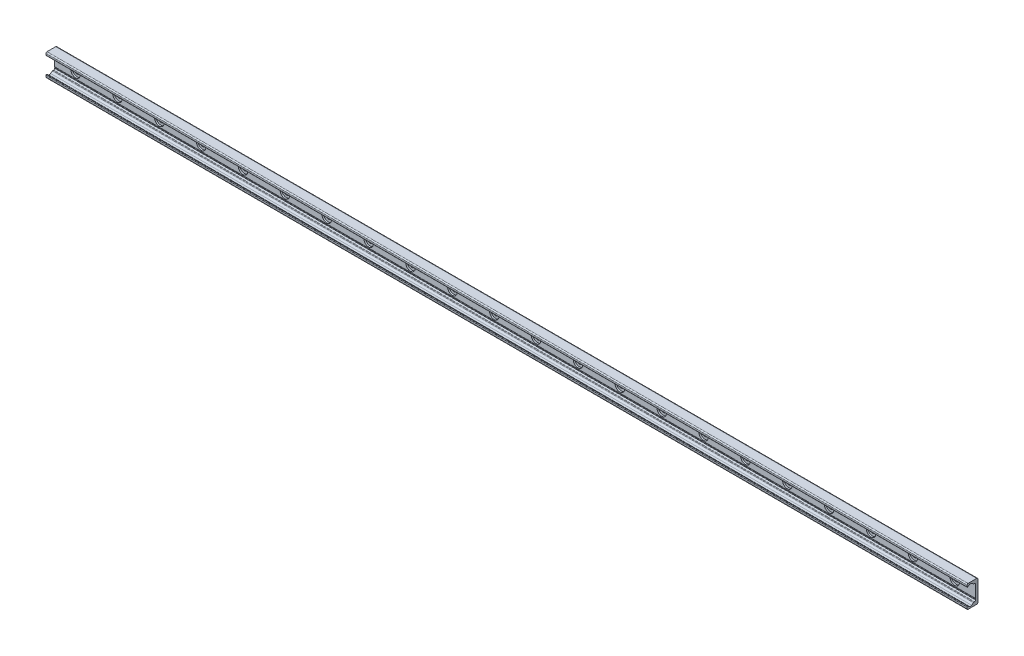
from build123d import *

# Parameters (mm, degrees)
BOSS_EXTRUDE1_DEPTH = 880
SKETCH2_R           = 9
SKETCH2_R_2         = 4.5
CUT_EXTRUDE1_DEPTH  = 3.1
SKETCH2_2_R         = 4.5
CUT_EXTRUDE2_DEPTH  = 881.417230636
LPATTERN1_COUNT     = 22
LPATTERN1_PITCH     = 80


with BuildPart() as part:
    # Sketch1 → Boss-Extrude1 (new, symmetric)
    with BuildSketch(Plane(origin=(0, 0, 0), x_dir=(0, 0, -1), z_dir=(1, 0, 0))):
        with BuildLine():
            Line((0, 0), (0, 19))
            ThreePointArc((0, 19), (-0.732233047, 20.767766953), (-2.5, 21.5))
            Line((-2.5, 21.5), (-19, 21.5))
            ThreePointArc((-19, 21.5), (-20.414213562, 20.914213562), (-21, 19.5))
            Line((-21, 19.5), (-21, 16.625057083))
            ThreePointArc((-21, 16.625057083), (-20.553251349, 15.888838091), (-19.693931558, 15.945160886))
            Line((-19.693931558, 15.945160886), (-16.794305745, 17.975500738))
            ThreePointArc((-16.794305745, 17.975500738), (-14.5, 18.69889256), (-12.205694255, 17.975500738))
            Line((-12.205694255, 17.975500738), (-8.829831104, 15.611695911))
            ThreePointArc((-8.829831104, 15.611695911), (-8.28408983, 15.342566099), (-7.682678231, 15.25))
            Line((-7.682678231, 15.25), (-6.5, 15.25))
            ThreePointArc((-6.5, 15.25), (-5.085786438, 14.664213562), (-4.5, 13.25))
            Line((-4.5, 13.25), (-4.5, -10.75))
            ThreePointArc((-4.5, -10.75), (-4.25, -11), (-4.5, -11.25))
            Line((-4.5, -11.25), (-4.5, -12.25))
            ThreePointArc((-4.5, -12.25), (-4.25, -12.5), (-4.5, -12.75))
            Line((-4.5, -12.75), (-4.5, -13.25))
            ThreePointArc((-4.5, -13.25), (-5.085786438, -14.664213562), (-6.5, -15.25))
            Line((-6.5, -15.25), (-7.682678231, -15.25))
            ThreePointArc((-7.682678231, -15.25), (-8.28408983, -15.342566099), (-8.829831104, -15.611695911))
            Line((-8.829831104, -15.611695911), (-12.205694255, -17.975500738))
            ThreePointArc((-12.205694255, -17.975500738), (-14.5, -18.69889256), (-16.794305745, -17.975500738))
            Line((-16.794305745, -17.975500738), (-19.693931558, -15.945160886))
            ThreePointArc((-19.693931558, -15.945160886), (-20.553251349, -15.888838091), (-21, -16.625057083))
            Line((-21, -16.625057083), (-21, -19.5))
            ThreePointArc((-21, -19.5), (-20.414213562, -20.914213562), (-19, -21.5))
            Line((-19, -21.5), (-2.5, -21.5))
            ThreePointArc((-2.5, -21.5), (-0.732233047, -20.767766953), (0, -19))
            Line((0, -19), (0, 0))
        make_face()
    extrude(amount=BOSS_EXTRUDE1_DEPTH, both=True)

    # Sketch2 → Cut-Extrude1 (cut)
    with BuildSketch(Plane.XY.offset(4.5)):
        with Locations((840, 0)):
            Circle(SKETCH2_R)
        with Locations((840, 0)):
            Circle(SKETCH2_R_2, mode=Mode.SUBTRACT)
    cut_extrude1 = extrude(amount=-CUT_EXTRUDE1_DEPTH, mode=Mode.SUBTRACT)

    # Sketch2_2 → Cut-Extrude2 (cut, through all)
    with BuildSketch(Plane.XY.offset(4.5)):
        with Locations((840, 0)):
            Circle(SKETCH2_2_R)
    cut_extrude2 = extrude(amount=-CUT_EXTRUDE2_DEPTH, mode=Mode.SUBTRACT)

    # LPattern1: Cut-Extrude1, Cut-Extrude2 ×22
    with Locations(*[(-i * LPATTERN1_PITCH, 0, 0) for i in range(1, LPATTERN1_COUNT)]):
        add(cut_extrude1, mode=Mode.SUBTRACT)
        add(cut_extrude2, mode=Mode.SUBTRACT)


solid = part.part
